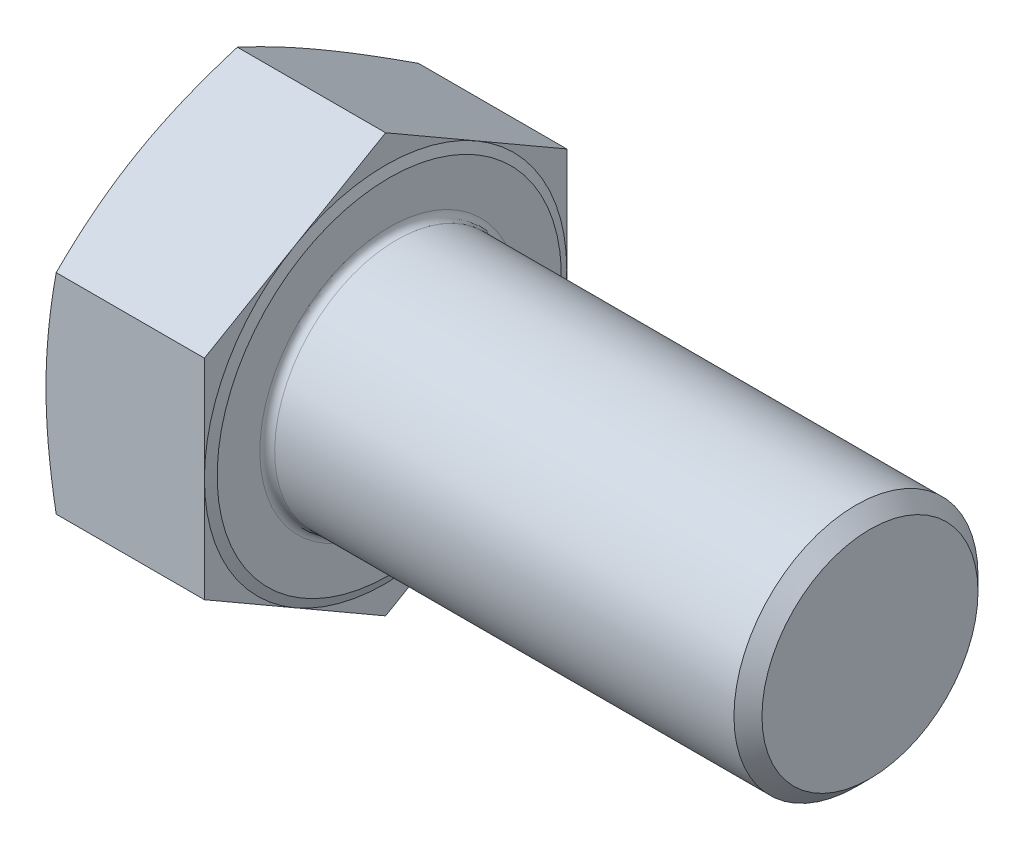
ISO-10303-21;
HEADER;
FILE_DESCRIPTION(('STEP AP214'),'2;1');
FILE_NAME('part.step','',(''),(''),'','','');
FILE_SCHEMA(('AUTOMOTIVE_DESIGN { 1 0 10303 214 1 1 1 1 }'));
ENDSEC;
DATA;
#1=APPLICATION_CONTEXT('core data for automotive mechanical design processes');
#2=APPLICATION_PROTOCOL_DEFINITION('international standard','automotive_design',2000,#1);
#3=PRODUCT_CONTEXT('',#1,'mechanical');
#4=PRODUCT('Part','Part','',(#3));
#5=PRODUCT_RELATED_PRODUCT_CATEGORY('part','',(#4));
#6=PRODUCT_DEFINITION_FORMATION('','',#4);
#7=PRODUCT_DEFINITION_CONTEXT('part definition',#1,'design');
#8=PRODUCT_DEFINITION('design','',#6,#7);
#9=PRODUCT_DEFINITION_SHAPE('','',#8);
#10=(LENGTH_UNIT() NAMED_UNIT(*) SI_UNIT(.MILLI.,.METRE.));
#11=(NAMED_UNIT(*) PLANE_ANGLE_UNIT() SI_UNIT($,.RADIAN.));
#12=(NAMED_UNIT(*) SI_UNIT($,.STERADIAN.) SOLID_ANGLE_UNIT());
#13=UNCERTAINTY_MEASURE_WITH_UNIT(LENGTH_MEASURE(1.E-05),#10,'distance_accuracy_value','');
#14=(GEOMETRIC_REPRESENTATION_CONTEXT(3) GLOBAL_UNCERTAINTY_ASSIGNED_CONTEXT((#13)) GLOBAL_UNIT_ASSIGNED_CONTEXT((#10,
#11,#12)) REPRESENTATION_CONTEXT('',''));
#15=CARTESIAN_POINT('',(0.,0.,0.));
#16=DIRECTION('',(0.,0.,1.));
#17=DIRECTION('',(1.,0.,0.));
#18=AXIS2_PLACEMENT_3D('',#15,#16,#17);
#19=CARTESIAN_POINT('',(21.92,0.,0.));
#20=DIRECTION('',(-1.,0.,0.));
#21=DIRECTION('',(0.,-1.,0.));
#22=AXIS2_PLACEMENT_3D('',#19,#20,#21);
#23=PLANE('',#22);
#24=CARTESIAN_POINT('',(21.92,0.,0.));
#25=DIRECTION('',(-1.,0.,0.));
#26=DIRECTION('',(0.,-1.,0.));
#27=AXIS2_PLACEMENT_3D('',#24,#25,#26);
#28=CIRCLE('',#27,17.5);
#29=CARTESIAN_POINT('',(21.92,-17.5,0.));
#30=VERTEX_POINT('',#29);
#31=EDGE_CURVE('E11',#30,#30,#28,.T.);
#32=ORIENTED_EDGE('',*,*,#31,.T.);
#33=EDGE_LOOP('',(#32));
#34=FACE_BOUND('',#33,.T.);
#35=CARTESIAN_POINT('',(21.92,0.,0.));
#36=DIRECTION('',(-1.,0.,0.));
#37=DIRECTION('',(0.,-1.,0.));
#38=AXIS2_PLACEMENT_3D('',#35,#36,#37);
#39=CIRCLE('',#38,23.275);
#40=CARTESIAN_POINT('',(21.92,-23.275,0.));
#41=VERTEX_POINT('',#40);
#42=EDGE_CURVE('E139',#41,#41,#39,.T.);
#43=ORIENTED_EDGE('',*,*,#42,.F.);
#44=EDGE_LOOP('',(#43));
#45=FACE_BOUND('',#44,.T.);
#46=ADVANCED_FACE('F32',(#34,#45),#23,.F.);
#47=CARTESIAN_POINT('',(21.42,-42.4352447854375,-24.5));
#48=DIRECTION('',(1.,0.,0.));
#49=DIRECTION('',(0.,0.,-1.));
#50=AXIS2_PLACEMENT_3D('',#47,#48,#49);
#51=PLANE('',#50);
#52=DIRECTION('',(0.,-0.5,-0.866025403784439));
#53=VECTOR('',#52,1.);
#54=CARTESIAN_POINT('',(21.42,-14.1450815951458,24.5));
#55=LINE('',#54,#53);
#56=CARTESIAN_POINT('',(21.42,-14.1450815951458,24.5));
#57=VERTEX_POINT('',#56);
#58=CARTESIAN_POINT('',(21.42,-21.2176223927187,12.25));
#59=VERTEX_POINT('',#58);
#60=EDGE_CURVE('E138',#57,#59,#55,.T.);
#61=ORIENTED_EDGE('',*,*,#60,.T.);
#62=CARTESIAN_POINT('',(21.42,0.,0.));
#63=DIRECTION('',(-1.,0.,0.));
#64=DIRECTION('',(0.,-1.,0.));
#65=AXIS2_PLACEMENT_3D('',#62,#63,#64);
#66=CIRCLE('',#65,24.5);
#67=CARTESIAN_POINT('',(21.42,0.,24.5));
#68=VERTEX_POINT('',#67);
#69=EDGE_CURVE('E48',#59,#68,#66,.T.);
#70=ORIENTED_EDGE('',*,*,#69,.T.);
#71=DIRECTION('',(0.,-1.,0.));
#72=VECTOR('',#71,1.);
#73=CARTESIAN_POINT('',(21.42,14.1450815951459,24.5));
#74=LINE('',#73,#72);
#75=EDGE_CURVE('E135',#68,#57,#74,.T.);
#76=ORIENTED_EDGE('',*,*,#75,.T.);
#77=EDGE_LOOP('',(#61,#70,#76));
#78=FACE_BOUND('',#77,.T.);
#79=ADVANCED_FACE('F134',(#78),#51,.T.);
#80=CARTESIAN_POINT('',(21.42,14.1450815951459,24.5));
#81=VERTEX_POINT('',#80);
#82=EDGE_CURVE('E146',#81,#68,#74,.T.);
#83=ORIENTED_EDGE('',*,*,#82,.T.);
#84=CARTESIAN_POINT('',(21.42,21.2176223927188,12.25));
#85=VERTEX_POINT('',#84);
#86=EDGE_CURVE('E121',#68,#85,#66,.T.);
#87=ORIENTED_EDGE('',*,*,#86,.T.);
#88=DIRECTION('',(0.,-0.5,0.866025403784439));
#89=VECTOR('',#88,1.);
#90=CARTESIAN_POINT('',(21.42,28.2901631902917,0.));
#91=LINE('',#90,#89);
#92=EDGE_CURVE('E152',#85,#81,#91,.T.);
#93=ORIENTED_EDGE('',*,*,#92,.T.);
#94=EDGE_LOOP('',(#83,#87,#93));
#95=FACE_BOUND('',#94,.T.);
#96=ADVANCED_FACE('F151',(#95),#51,.T.);
#97=CARTESIAN_POINT('',(21.42,28.2901631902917,0.));
#98=VERTEX_POINT('',#97);
#99=EDGE_CURVE('E149',#98,#85,#91,.T.);
#100=ORIENTED_EDGE('',*,*,#99,.T.);
#101=CARTESIAN_POINT('',(21.42,21.2176223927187,-12.25));
#102=VERTEX_POINT('',#101);
#103=EDGE_CURVE('E125',#85,#102,#66,.T.);
#104=ORIENTED_EDGE('',*,*,#103,.T.);
#105=DIRECTION('',(0.,0.5,0.866025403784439));
#106=VECTOR('',#105,1.);
#107=CARTESIAN_POINT('',(21.42,14.1450815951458,-24.5));
#108=LINE('',#107,#106);
#109=EDGE_CURVE('E308',#102,#98,#108,.T.);
#110=ORIENTED_EDGE('',*,*,#109,.T.);
#111=EDGE_LOOP('',(#100,#104,#110));
#112=FACE_BOUND('',#111,.T.);
#113=ADVANCED_FACE('F320',(#112),#51,.T.);
#114=CARTESIAN_POINT('',(21.42,14.1450815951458,-24.5));
#115=VERTEX_POINT('',#114);
#116=EDGE_CURVE('E310',#115,#102,#108,.T.);
#117=ORIENTED_EDGE('',*,*,#116,.T.);
#118=CARTESIAN_POINT('',(21.42,0.,-24.5));
#119=VERTEX_POINT('',#118);
#120=EDGE_CURVE('E364',#102,#119,#66,.T.);
#121=ORIENTED_EDGE('',*,*,#120,.T.);
#122=DIRECTION('',(0.,1.,0.));
#123=VECTOR('',#122,1.);
#124=CARTESIAN_POINT('',(21.42,-14.1450815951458,-24.5));
#125=LINE('',#124,#123);
#126=EDGE_CURVE('E305',#119,#115,#125,.T.);
#127=ORIENTED_EDGE('',*,*,#126,.T.);
#128=EDGE_LOOP('',(#117,#121,#127));
#129=FACE_BOUND('',#128,.T.);
#130=ADVANCED_FACE('F365',(#129),#51,.T.);
#131=CARTESIAN_POINT('',(21.42,-14.1450815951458,-24.5));
#132=VERTEX_POINT('',#131);
#133=EDGE_CURVE('E303',#132,#119,#125,.T.);
#134=ORIENTED_EDGE('',*,*,#133,.T.);
#135=CARTESIAN_POINT('',(21.42,-21.2176223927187,-12.25));
#136=VERTEX_POINT('',#135);
#137=EDGE_CURVE('E348',#119,#136,#66,.T.);
#138=ORIENTED_EDGE('',*,*,#137,.T.);
#139=DIRECTION('',(0.,0.5,-0.866025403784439));
#140=VECTOR('',#139,1.);
#141=CARTESIAN_POINT('',(21.42,-28.2901631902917,0.));
#142=LINE('',#141,#140);
#143=EDGE_CURVE('E362',#136,#132,#142,.T.);
#144=ORIENTED_EDGE('',*,*,#143,.T.);
#145=EDGE_LOOP('',(#134,#138,#144));
#146=FACE_BOUND('',#145,.T.);
#147=ADVANCED_FACE('F363',(#146),#51,.T.);
#148=CARTESIAN_POINT('',(21.42,-28.2901631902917,0.));
#149=VERTEX_POINT('',#148);
#150=EDGE_CURVE('E311',#149,#136,#142,.T.);
#151=ORIENTED_EDGE('',*,*,#150,.T.);
#152=EDGE_CURVE('E140',#136,#59,#66,.T.);
#153=ORIENTED_EDGE('',*,*,#152,.T.);
#154=EDGE_CURVE('E357',#59,#149,#55,.T.);
#155=ORIENTED_EDGE('',*,*,#154,.T.);
#156=EDGE_LOOP('',(#151,#153,#155));
#157=FACE_BOUND('',#156,.T.);
#158=ADVANCED_FACE('F206',(#157),#51,.T.);
#159=CARTESIAN_POINT('',(21.42,-14.1450815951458,24.5));
#160=DIRECTION('',(0.,0.866025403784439,-0.5));
#161=DIRECTION('',(0.,0.5,0.866025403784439));
#162=AXIS2_PLACEMENT_3D('',#159,#160,#161);
#163=PLANE('',#162);
#164=CARTESIAN_POINT('',(1.37954861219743,-28.2902786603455,-0.000200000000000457));
#165=CARTESIAN_POINT('',(1.27293694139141,-27.9973434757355,0.50717862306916));
#166=CARTESIAN_POINT('',(1.17111989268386,-27.7039777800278,1.01530291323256));
#167=CARTESIAN_POINT('',(0.978129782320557,-27.1163453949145,2.0331120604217));
#168=CARTESIAN_POINT('',(0.886957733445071,-26.8220786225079,2.54279706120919));
#169=CARTESIAN_POINT('',(0.630902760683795,-25.9375429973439,4.07485770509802));
#170=CARTESIAN_POINT('',(0.483631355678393,-25.3459437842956,5.09953759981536));
#171=CARTESIAN_POINT('',(0.304650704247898,-24.4592941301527,6.63525984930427));
#172=CARTESIAN_POINT('',(0.252130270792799,-24.1652666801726,7.14453033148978));
#173=CARTESIAN_POINT('',(0.161428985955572,-23.5766492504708,8.16404562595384));
#174=CARTESIAN_POINT('',(0.12324821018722,-23.2820592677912,8.67429044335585));
#175=CARTESIAN_POINT('',(0.0618973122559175,-22.6925960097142,9.69527075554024));
#176=CARTESIAN_POINT('',(0.038721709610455,-22.3977228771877,10.206006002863));
#177=CARTESIAN_POINT('',(0.00777307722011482,-21.8077739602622,11.2278275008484));
#178=CARTESIAN_POINT('',(0.,-21.5126981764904,11.7389137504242));
#179=CARTESIAN_POINT('',(0.,-20.922546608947,12.7610862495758));
#180=CARTESIAN_POINT('',(0.00777307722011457,-20.6274708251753,13.2721724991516));
#181=CARTESIAN_POINT('',(0.0387217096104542,-20.0375219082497,14.293993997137));
#182=CARTESIAN_POINT('',(0.0618973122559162,-19.7426487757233,14.8047292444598));
#183=CARTESIAN_POINT('',(0.123248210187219,-19.1531855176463,15.8257095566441));
#184=CARTESIAN_POINT('',(0.161428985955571,-18.8585955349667,16.3359543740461));
#185=CARTESIAN_POINT('',(0.252130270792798,-18.2699781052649,17.3554696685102));
#186=CARTESIAN_POINT('',(0.304650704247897,-17.9759506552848,17.8647401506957));
#187=CARTESIAN_POINT('',(0.483631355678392,-17.0893010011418,19.4004624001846));
#188=CARTESIAN_POINT('',(0.630902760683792,-16.4977017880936,20.425142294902));
#189=CARTESIAN_POINT('',(0.886957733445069,-15.6131661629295,21.9572029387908));
#190=CARTESIAN_POINT('',(0.978129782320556,-15.318899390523,22.4668879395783));
#191=CARTESIAN_POINT('',(1.17111989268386,-14.7312670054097,23.4846970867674));
#192=CARTESIAN_POINT('',(1.27293694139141,-14.437901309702,23.9928213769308));
#193=CARTESIAN_POINT('',(1.37954861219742,-14.144966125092,24.5002));
#194=B_SPLINE_CURVE_WITH_KNOTS('',3,(#164,#165,#166,#167,#168,#169,#170,#171,#172,#173,#174,
#175,#176,#177,#178,#179,#180,#181,#182,#183,#184,#185,#186,#187,#188,#189,#190,#191,#192,#193),
.UNSPECIFIED.,.F.,.F.,(4,2,2,2,2,2,2,2,2,2,2,2,2,2,4),(0.,1.78642146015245,3.57301274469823,
7.14866503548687,8.91971216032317,10.6907686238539,12.4611778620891,14.2315816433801,
16.0019854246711,17.7723946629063,19.543451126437,21.3144982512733,24.890150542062,
26.6767418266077,28.4631632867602),.UNSPECIFIED.);
#195=CARTESIAN_POINT('',(1.37950658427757,-28.2901631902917,0.));
#196=VERTEX_POINT('',#195);
#197=CARTESIAN_POINT('',(0.,-21.2176223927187,12.25));
#198=VERTEX_POINT('',#197);
#199=EDGE_CURVE('E351',#196,#198,#194,.T.);
#200=ORIENTED_EDGE('',*,*,#199,.F.);
#201=DIRECTION('',(-1.,0.,0.));
#202=VECTOR('',#201,1.);
#203=CARTESIAN_POINT('',(21.42,-28.2901631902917,0.));
#204=LINE('',#203,#202);
#205=EDGE_CURVE('E169',#149,#196,#204,.T.);
#206=ORIENTED_EDGE('',*,*,#205,.F.);
#207=ORIENTED_EDGE('',*,*,#154,.F.);
#208=ORIENTED_EDGE('',*,*,#60,.F.);
#209=DIRECTION('',(-1.,0.,0.));
#210=VECTOR('',#209,1.);
#211=CARTESIAN_POINT('',(21.42,-14.1450815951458,24.5));
#212=LINE('',#211,#210);
#213=CARTESIAN_POINT('',(1.37950658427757,-14.1450815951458,24.5));
#214=VERTEX_POINT('',#213);
#215=EDGE_CURVE('E148',#57,#214,#212,.T.);
#216=ORIENTED_EDGE('',*,*,#215,.T.);
#217=EDGE_CURVE('E240',#198,#214,#194,.T.);
#218=ORIENTED_EDGE('',*,*,#217,.F.);
#219=EDGE_LOOP('',(#200,#206,#207,#208,#216,#218));
#220=FACE_BOUND('',#219,.T.);
#221=ADVANCED_FACE('F34',(#220),#163,.F.);
#222=CARTESIAN_POINT('',(21.42,-28.2901631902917,0.));
#223=DIRECTION('',(0.,0.866025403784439,0.5));
#224=DIRECTION('',(0.,-0.5,0.866025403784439));
#225=AXIS2_PLACEMENT_3D('',#222,#223,#224);
#226=PLANE('',#225);
#227=CARTESIAN_POINT('',(1.37954861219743,-14.144966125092,-24.5002));
#228=CARTESIAN_POINT('',(1.27293694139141,-14.437901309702,-23.9928213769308));
#229=CARTESIAN_POINT('',(1.17111989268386,-14.7312670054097,-23.4846970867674));
#230=CARTESIAN_POINT('',(0.978129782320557,-15.318899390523,-22.4668879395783));
#231=CARTESIAN_POINT('',(0.88695773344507,-15.6131661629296,-21.9572029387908));
#232=CARTESIAN_POINT('',(0.630902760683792,-16.4977017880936,-20.425142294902));
#233=CARTESIAN_POINT('',(0.483631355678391,-17.0893010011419,-19.4004624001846));
#234=CARTESIAN_POINT('',(0.304650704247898,-17.9759506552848,-17.8647401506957));
#235=CARTESIAN_POINT('',(0.2521302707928,-18.2699781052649,-17.3554696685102));
#236=CARTESIAN_POINT('',(0.161428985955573,-18.8585955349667,-16.3359543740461));
#237=CARTESIAN_POINT('',(0.12324821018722,-19.1531855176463,-15.8257095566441));
#238=CARTESIAN_POINT('',(0.061897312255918,-19.7426487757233,-14.8047292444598));
#239=CARTESIAN_POINT('',(0.0387217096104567,-20.0375219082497,-14.293993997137));
#240=CARTESIAN_POINT('',(0.00777307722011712,-20.6274708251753,-13.2721724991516));
#241=CARTESIAN_POINT('',(0.,-20.922546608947,-12.7610862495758));
#242=CARTESIAN_POINT('',(0.,-21.5126981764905,-11.7389137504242));
#243=CARTESIAN_POINT('',(0.00777307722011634,-21.8077739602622,-11.2278275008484));
#244=CARTESIAN_POINT('',(0.038721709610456,-22.3977228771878,-10.206006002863));
#245=CARTESIAN_POINT('',(0.0618973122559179,-22.6925960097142,-9.69527075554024));
#246=CARTESIAN_POINT('',(0.12324821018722,-23.2820592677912,-8.67429044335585));
#247=CARTESIAN_POINT('',(0.161428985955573,-23.5766492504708,-8.16404562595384));
#248=CARTESIAN_POINT('',(0.252130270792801,-24.1652666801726,-7.14453033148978));
#249=CARTESIAN_POINT('',(0.304650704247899,-24.4592941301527,-6.63525984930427));
#250=CARTESIAN_POINT('',(0.483631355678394,-25.3459437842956,-5.09953759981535));
#251=CARTESIAN_POINT('',(0.630902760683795,-25.9375429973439,-4.07485770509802));
#252=CARTESIAN_POINT('',(0.886957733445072,-26.8220786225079,-2.54279706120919));
#253=CARTESIAN_POINT('',(0.978129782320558,-27.1163453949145,-2.0331120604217));
#254=CARTESIAN_POINT('',(1.17111989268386,-27.7039777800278,-1.01530291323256));
#255=CARTESIAN_POINT('',(1.27293694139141,-27.9973434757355,-0.507178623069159));
#256=CARTESIAN_POINT('',(1.37954861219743,-28.2902786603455,0.000200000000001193));
#257=B_SPLINE_CURVE_WITH_KNOTS('',3,(#227,#228,#229,#230,#231,#232,#233,#234,#235,#236,#237,
#238,#239,#240,#241,#242,#243,#244,#245,#246,#247,#248,#249,#250,#251,#252,#253,#254,#255,#256),
.UNSPECIFIED.,.F.,.F.,(4,2,2,2,2,2,2,2,2,2,2,2,2,2,4),(0.,1.78642146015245,3.57301274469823,
7.14866503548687,8.91971216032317,10.6907686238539,12.4611778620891,14.2315816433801,
16.0019854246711,17.7723946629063,19.543451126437,21.3144982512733,24.890150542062,
26.6767418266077,28.4631632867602),.UNSPECIFIED.);
#258=CARTESIAN_POINT('',(1.37950658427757,-14.1450815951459,-24.5));
#259=VERTEX_POINT('',#258);
#260=CARTESIAN_POINT('',(0.,-21.2176223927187,-12.25));
#261=VERTEX_POINT('',#260);
#262=EDGE_CURVE('E254',#259,#261,#257,.T.);
#263=ORIENTED_EDGE('',*,*,#262,.F.);
#264=DIRECTION('',(-1.,0.,0.));
#265=VECTOR('',#264,1.);
#266=CARTESIAN_POINT('',(21.42,-14.1450815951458,-24.5));
#267=LINE('',#266,#265);
#268=EDGE_CURVE('E166',#132,#259,#267,.T.);
#269=ORIENTED_EDGE('',*,*,#268,.F.);
#270=ORIENTED_EDGE('',*,*,#143,.F.);
#271=ORIENTED_EDGE('',*,*,#150,.F.);
#272=ORIENTED_EDGE('',*,*,#205,.T.);
#273=EDGE_CURVE('E250',#261,#196,#257,.T.);
#274=ORIENTED_EDGE('',*,*,#273,.F.);
#275=EDGE_LOOP('',(#263,#269,#270,#271,#272,#274));
#276=FACE_BOUND('',#275,.T.);
#277=ADVANCED_FACE('F261',(#276),#226,.F.);
#278=CARTESIAN_POINT('',(21.42,-14.1450815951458,-24.5));
#279=DIRECTION('',(0.,0.,1.));
#280=DIRECTION('',(0.,-1.,0.));
#281=AXIS2_PLACEMENT_3D('',#278,#279,#280);
#282=PLANE('',#281);
#283=CARTESIAN_POINT('',(7.37153610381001,-37.4512023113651,-24.5));
#284=CARTESIAN_POINT('',(7.20273071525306,-36.8969761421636,-24.5));
#285=CARTESIAN_POINT('',(7.03494618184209,-36.342439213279,-24.5));
#286=CARTESIAN_POINT('',(6.70164736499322,-35.2326801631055,-24.5));
#287=CARTESIAN_POINT('',(6.5361330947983,-34.6774580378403,-24.5));
#288=CARTESIAN_POINT('',(6.04331714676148,-33.0105959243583,-24.5));
#289=CARTESIAN_POINT('',(5.71976735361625,-31.8978421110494,-24.5));
#290=CARTESIAN_POINT('',(5.08438525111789,-29.6667408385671,-24.5));
#291=CARTESIAN_POINT('',(4.77257592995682,-28.5483868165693,-24.5));
#292=CARTESIAN_POINT('',(4.16429849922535,-26.3075191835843,-24.5));
#293=CARTESIAN_POINT('',(3.86783011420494,-25.1850056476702,-24.5));
#294=CARTESIAN_POINT('',(3.29757977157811,-22.9489412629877,-24.5));
#295=CARTESIAN_POINT('',(3.0235631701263,-21.8354505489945,-24.5));
#296=CARTESIAN_POINT('',(2.49885882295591,-19.602928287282,-24.5));
#297=CARTESIAN_POINT('',(2.24817146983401,-18.4838966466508,-24.5));
#298=CARTESIAN_POINT('',(1.77597066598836,-16.2400420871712,-24.5));
#299=CARTESIAN_POINT('',(1.55444726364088,-15.1152212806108,-24.5));
#300=CARTESIAN_POINT('',(1.14731954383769,-12.8590493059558,-24.5));
#301=CARTESIAN_POINT('',(0.961714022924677,-11.727698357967,-24.5));
#302=CARTESIAN_POINT('',(0.652339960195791,-9.58586065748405,-24.5));
#303=CARTESIAN_POINT('',(0.523971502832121,-8.57604457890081,-24.5));
#304=CARTESIAN_POINT('',(0.306674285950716,-6.55214241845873,-24.5));
#305=CARTESIAN_POINT('',(0.217744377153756,-5.53805646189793,-24.5));
#306=CARTESIAN_POINT('',(0.0836069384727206,-3.50767148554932,-24.5));
#307=CARTESIAN_POINT('',(0.038368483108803,-2.49137454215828,-24.5));
#308=CARTESIAN_POINT('',(-0.00609563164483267,-0.457763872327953,-24.5));
#309=CARTESIAN_POINT('',(-0.00532161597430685,0.559549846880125,-24.5));
#310=CARTESIAN_POINT('',(0.042317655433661,2.59824171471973,-24.5));
#311=CARTESIAN_POINT('',(0.0894166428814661,3.61961431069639,-24.5));
#312=CARTESIAN_POINT('',(0.227538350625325,5.6593594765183,-24.5));
#313=CARTESIAN_POINT('',(0.318562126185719,6.67773197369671,-24.5));
#314=CARTESIAN_POINT('',(0.540275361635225,8.71097408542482,-24.5));
#315=CARTESIAN_POINT('',(0.670998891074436,9.725839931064,-24.5));
#316=CARTESIAN_POINT('',(0.966809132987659,11.7504944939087,-24.5));
#317=CARTESIAN_POINT('',(1.13189602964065,12.7602831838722,-24.5));
#318=CARTESIAN_POINT('',(1.50055978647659,14.8279200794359,-24.5));
#319=CARTESIAN_POINT('',(1.70571067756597,15.8854851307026,-24.5));
#320=CARTESIAN_POINT('',(2.14241659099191,17.9951843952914,-24.5));
#321=CARTESIAN_POINT('',(2.37397360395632,19.0473181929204,-24.5));
#322=CARTESIAN_POINT('',(2.8586295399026,21.1469046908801,-24.5));
#323=CARTESIAN_POINT('',(3.11173471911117,22.1943559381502,-24.5));
#324=CARTESIAN_POINT('',(3.63536971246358,24.2848459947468,-24.5));
#325=CARTESIAN_POINT('',(3.90589910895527,25.3278849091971,-24.5));
#326=CARTESIAN_POINT('',(4.46148207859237,27.4115083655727,-24.5));
#327=CARTESIAN_POINT('',(4.74655385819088,28.4520880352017,-24.5));
#328=CARTESIAN_POINT('',(5.32829383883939,30.5299963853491,-24.5));
#329=CARTESIAN_POINT('',(5.62496208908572,31.5673250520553,-24.5));
#330=CARTESIAN_POINT('',(6.22777248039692,33.6390312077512,-24.5));
#331=CARTESIAN_POINT('',(6.53391302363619,34.6734091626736,-24.5));
#332=CARTESIAN_POINT('',(7.15406959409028,36.7397951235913,-24.5));
#333=CARTESIAN_POINT('',(7.46808560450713,37.7718031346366,-24.5));
#334=CARTESIAN_POINT('',(8.09917818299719,39.8224136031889,-24.5));
#335=CARTESIAN_POINT('',(8.41618268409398,40.8410382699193,-24.5));
#336=CARTESIAN_POINT('',(9.05559160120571,42.8765897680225,-24.5));
#337=CARTESIAN_POINT('',(9.37799601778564,43.8935165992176,-24.5));
#338=CARTESIAN_POINT('',(10.0273937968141,45.9259541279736,-24.5));
#339=CARTESIAN_POINT('',(10.3543873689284,46.9414647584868,-24.5));
#340=CARTESIAN_POINT('',(11.0122763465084,48.9712215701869,-24.5));
#341=CARTESIAN_POINT('',(11.3431717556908,49.9854677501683,-24.5));
#342=CARTESIAN_POINT('',(12.0070492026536,52.00901284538,-24.5));
#343=CARTESIAN_POINT('',(12.3400185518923,53.0183159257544,-24.5));
#344=CARTESIAN_POINT('',(13.0088305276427,55.0359698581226,-24.5));
#345=CARTESIAN_POINT('',(13.3446731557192,56.0443207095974,-24.5));
#346=CARTESIAN_POINT('',(14.0188253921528,58.0601052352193,-24.5));
#347=CARTESIAN_POINT('',(14.3571347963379,59.067538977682,-24.5));
#348=CARTESIAN_POINT('',(15.0359426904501,61.0816660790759,-24.5));
#349=CARTESIAN_POINT('',(15.3764411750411,62.0883594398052,-24.5));
#350=CARTESIAN_POINT('',(15.7178824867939,63.0947321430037,-24.5));
#351=B_SPLINE_CURVE_WITH_KNOTS('',3,(#283,#284,#285,#286,#287,#288,#289,#290,#291,#292,#293,
#294,#295,#296,#297,#298,#299,#300,#301,#302,#303,#304,#305,#306,#307,#308,#309,#310,#311,#312,
#313,#314,#315,#316,#317,#318,#319,#320,#321,#322,#323,#324,#325,#326,#327,#328,#329,#330,#331,
#332,#333,#334,#335,#336,#337,#338,#339,#340,#341,#342,#343,#344,#345,#346,#347,#348,#349,#350),
.UNSPECIFIED.,.F.,.F.,(4,2,2,2,2,2,2,2,2,2,2,2,2,2,2,2,2,2,2,2,2,2,2,2,2,2,2,2,2,2,2,2,2,4),(0.,
1.7380882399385,3.47618661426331,6.95264030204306,10.4355801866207,13.9184575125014,
17.3583927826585,20.7983859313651,24.2372021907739,27.6759032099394,30.7290603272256,
33.7821284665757,36.8330340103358,39.8839180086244,42.9502745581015,46.0167047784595,
49.0857740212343,52.1548597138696,55.3862843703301,58.6179527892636,61.8505627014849,
65.0830951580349,68.3197789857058,71.5564765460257,74.7926310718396,78.0287786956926,
81.2291974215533,84.4296164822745,87.6301822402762,90.8307510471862,94.019170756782,
97.2075922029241,100.395752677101,103.583905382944),.UNSPECIFIED.);
#352=CARTESIAN_POINT('',(1.37950658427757,14.1450815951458,-24.5));
#353=VERTEX_POINT('',#352);
#354=CARTESIAN_POINT('',(0.,0.,-24.5));
#355=VERTEX_POINT('',#354);
#356=EDGE_CURVE('E295',#353,#355,#351,.F.);
#357=ORIENTED_EDGE('',*,*,#356,.F.);
#358=DIRECTION('',(-1.,0.,0.));
#359=VECTOR('',#358,1.);
#360=CARTESIAN_POINT('',(21.42,14.1450815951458,-24.5));
#361=LINE('',#360,#359);
#362=EDGE_CURVE('E163',#115,#353,#361,.T.);
#363=ORIENTED_EDGE('',*,*,#362,.F.);
#364=ORIENTED_EDGE('',*,*,#126,.F.);
#365=ORIENTED_EDGE('',*,*,#133,.F.);
#366=ORIENTED_EDGE('',*,*,#268,.T.);
#367=EDGE_CURVE('E255',#355,#259,#351,.F.);
#368=ORIENTED_EDGE('',*,*,#367,.F.);
#369=EDGE_LOOP('',(#357,#363,#364,#365,#366,#368));
#370=FACE_BOUND('',#369,.T.);
#371=ADVANCED_FACE('F264',(#370),#282,.F.);
#372=CARTESIAN_POINT('',(21.42,14.1450815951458,-24.5));
#373=DIRECTION('',(0.,-0.866025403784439,0.5));
#374=DIRECTION('',(0.,-0.5,-0.866025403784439));
#375=AXIS2_PLACEMENT_3D('',#372,#373,#374);
#376=PLANE('',#375);
#377=CARTESIAN_POINT('',(1.37954861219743,28.2902786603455,0.000199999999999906));
#378=CARTESIAN_POINT('',(1.27293694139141,27.9973434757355,-0.507178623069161));
#379=CARTESIAN_POINT('',(1.17111989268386,27.7039777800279,-1.01530291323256));
#380=CARTESIAN_POINT('',(0.978129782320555,27.1163453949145,-2.0331120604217));
#381=CARTESIAN_POINT('',(0.886957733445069,26.822078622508,-2.54279706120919));
#382=CARTESIAN_POINT('',(0.630902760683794,25.9375429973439,-4.07485770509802));
#383=CARTESIAN_POINT('',(0.483631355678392,25.3459437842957,-5.09953759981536));
#384=CARTESIAN_POINT('',(0.304650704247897,24.4592941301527,-6.63525984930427));
#385=CARTESIAN_POINT('',(0.252130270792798,24.1652666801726,-7.14453033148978));
#386=CARTESIAN_POINT('',(0.161428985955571,23.5766492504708,-8.16404562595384));
#387=CARTESIAN_POINT('',(0.123248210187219,23.2820592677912,-8.67429044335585));
#388=CARTESIAN_POINT('',(0.0618973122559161,22.6925960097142,-9.69527075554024));
#389=CARTESIAN_POINT('',(0.0387217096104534,22.3977228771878,-10.206006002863));
#390=CARTESIAN_POINT('',(0.00777307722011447,21.8077739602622,-11.2278275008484));
#391=CARTESIAN_POINT('',(0.,21.5126981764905,-11.7389137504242));
#392=CARTESIAN_POINT('',(0.,20.9225466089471,-12.7610862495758));
#393=CARTESIAN_POINT('',(0.00777307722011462,20.6274708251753,-13.2721724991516));
#394=CARTESIAN_POINT('',(0.0387217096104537,20.0375219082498,-14.293993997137));
#395=CARTESIAN_POINT('',(0.0618973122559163,19.7426487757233,-14.8047292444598));
#396=CARTESIAN_POINT('',(0.123248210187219,19.1531855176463,-15.8257095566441));
#397=CARTESIAN_POINT('',(0.161428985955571,18.8585955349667,-16.3359543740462));
#398=CARTESIAN_POINT('',(0.252130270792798,18.2699781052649,-17.3554696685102));
#399=CARTESIAN_POINT('',(0.304650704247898,17.9759506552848,-17.8647401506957));
#400=CARTESIAN_POINT('',(0.483631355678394,17.0893010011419,-19.4004624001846));
#401=CARTESIAN_POINT('',(0.630902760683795,16.4977017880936,-20.425142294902));
#402=CARTESIAN_POINT('',(0.886957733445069,15.6131661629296,-21.9572029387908));
#403=CARTESIAN_POINT('',(0.978129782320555,15.318899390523,-22.4668879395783));
#404=CARTESIAN_POINT('',(1.17111989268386,14.7312670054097,-23.4846970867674));
#405=CARTESIAN_POINT('',(1.27293694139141,14.4379013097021,-23.9928213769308));
#406=CARTESIAN_POINT('',(1.37954861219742,14.144966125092,-24.5002));
#407=B_SPLINE_CURVE_WITH_KNOTS('',3,(#377,#378,#379,#380,#381,#382,#383,#384,#385,#386,#387,
#388,#389,#390,#391,#392,#393,#394,#395,#396,#397,#398,#399,#400,#401,#402,#403,#404,#405,#406),
.UNSPECIFIED.,.F.,.F.,(4,2,2,2,2,2,2,2,2,2,2,2,2,2,4),(0.,1.78642146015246,3.57301274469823,
7.14866503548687,8.91971216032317,10.6907686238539,12.4611778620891,14.2315816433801,
16.0019854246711,17.7723946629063,19.543451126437,21.3144982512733,24.890150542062,
26.6767418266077,28.4631632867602),.UNSPECIFIED.);
#408=CARTESIAN_POINT('',(1.37950658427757,28.2901631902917,0.));
#409=VERTEX_POINT('',#408);
#410=CARTESIAN_POINT('',(0.,21.2176223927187,-12.25));
#411=VERTEX_POINT('',#410);
#412=EDGE_CURVE('E56',#409,#411,#407,.T.);
#413=ORIENTED_EDGE('',*,*,#412,.F.);
#414=DIRECTION('',(-1.,0.,0.));
#415=VECTOR('',#414,1.);
#416=CARTESIAN_POINT('',(21.42,28.2901631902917,0.));
#417=LINE('',#416,#415);
#418=EDGE_CURVE('E160',#98,#409,#417,.T.);
#419=ORIENTED_EDGE('',*,*,#418,.F.);
#420=ORIENTED_EDGE('',*,*,#109,.F.);
#421=ORIENTED_EDGE('',*,*,#116,.F.);
#422=ORIENTED_EDGE('',*,*,#362,.T.);
#423=EDGE_CURVE('E296',#411,#353,#407,.T.);
#424=ORIENTED_EDGE('',*,*,#423,.F.);
#425=EDGE_LOOP('',(#413,#419,#420,#421,#422,#424));
#426=FACE_BOUND('',#425,.T.);
#427=ADVANCED_FACE('F268',(#426),#376,.F.);
#428=CARTESIAN_POINT('',(21.42,28.2901631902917,0.));
#429=DIRECTION('',(0.,-0.866025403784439,-0.5));
#430=DIRECTION('',(0.,0.5,-0.866025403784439));
#431=AXIS2_PLACEMENT_3D('',#428,#429,#430);
#432=PLANE('',#431);
#433=CARTESIAN_POINT('',(1.37954861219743,14.144966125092,24.5002));
#434=CARTESIAN_POINT('',(1.27293694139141,14.4379013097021,23.9928213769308));
#435=CARTESIAN_POINT('',(1.17111989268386,14.7312670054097,23.4846970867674));
#436=CARTESIAN_POINT('',(0.978129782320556,15.318899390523,22.4668879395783));
#437=CARTESIAN_POINT('',(0.88695773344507,15.6131661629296,21.9572029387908));
#438=CARTESIAN_POINT('',(0.630902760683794,16.4977017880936,20.425142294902));
#439=CARTESIAN_POINT('',(0.483631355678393,17.0893010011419,19.4004624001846));
#440=CARTESIAN_POINT('',(0.304650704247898,17.9759506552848,17.8647401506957));
#441=CARTESIAN_POINT('',(0.2521302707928,18.2699781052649,17.3554696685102));
#442=CARTESIAN_POINT('',(0.161428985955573,18.8585955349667,16.3359543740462));
#443=CARTESIAN_POINT('',(0.123248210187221,19.1531855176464,15.8257095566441));
#444=CARTESIAN_POINT('',(0.0618973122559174,19.7426487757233,14.8047292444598));
#445=CARTESIAN_POINT('',(0.0387217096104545,20.0375219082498,14.293993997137));
#446=CARTESIAN_POINT('',(0.00777307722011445,20.6274708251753,13.2721724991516));
#447=CARTESIAN_POINT('',(0.,20.9225466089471,12.7610862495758));
#448=CARTESIAN_POINT('',(0.,21.5126981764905,11.7389137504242));
#449=CARTESIAN_POINT('',(0.00777307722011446,21.8077739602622,11.2278275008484));
#450=CARTESIAN_POINT('',(0.038721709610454,22.3977228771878,10.206006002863));
#451=CARTESIAN_POINT('',(0.0618973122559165,22.6925960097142,9.69527075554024));
#452=CARTESIAN_POINT('',(0.123248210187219,23.2820592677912,8.67429044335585));
#453=CARTESIAN_POINT('',(0.161428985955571,23.5766492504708,8.16404562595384));
#454=CARTESIAN_POINT('',(0.252130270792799,24.1652666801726,7.14453033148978));
#455=CARTESIAN_POINT('',(0.304650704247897,24.4592941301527,6.63525984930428));
#456=CARTESIAN_POINT('',(0.483631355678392,25.3459437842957,5.09953759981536));
#457=CARTESIAN_POINT('',(0.630902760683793,25.9375429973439,4.07485770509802));
#458=CARTESIAN_POINT('',(0.88695773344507,26.822078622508,2.54279706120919));
#459=CARTESIAN_POINT('',(0.978129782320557,27.1163453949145,2.0331120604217));
#460=CARTESIAN_POINT('',(1.17111989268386,27.7039777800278,1.01530291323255));
#461=CARTESIAN_POINT('',(1.27293694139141,27.9973434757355,0.507178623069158));
#462=CARTESIAN_POINT('',(1.37954861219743,28.2902786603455,-0.000200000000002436));
#463=B_SPLINE_CURVE_WITH_KNOTS('',3,(#433,#434,#435,#436,#437,#438,#439,#440,#441,#442,#443,
#444,#445,#446,#447,#448,#449,#450,#451,#452,#453,#454,#455,#456,#457,#458,#459,#460,#461,#462),
.UNSPECIFIED.,.F.,.F.,(4,2,2,2,2,2,2,2,2,2,2,2,2,2,4),(0.,1.78642146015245,3.57301274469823,
7.14866503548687,8.91971216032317,10.6907686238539,12.4611778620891,14.2315816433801,
16.0019854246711,17.7723946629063,19.543451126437,21.3144982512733,24.890150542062,
26.6767418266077,28.4631632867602),.UNSPECIFIED.);
#464=CARTESIAN_POINT('',(1.37950658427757,14.1450815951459,24.5));
#465=VERTEX_POINT('',#464);
#466=CARTESIAN_POINT('',(0.,21.2176223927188,12.25));
#467=VERTEX_POINT('',#466);
#468=EDGE_CURVE('E233',#465,#467,#463,.T.);
#469=ORIENTED_EDGE('',*,*,#468,.F.);
#470=DIRECTION('',(-1.,0.,0.));
#471=VECTOR('',#470,1.);
#472=CARTESIAN_POINT('',(21.42,14.1450815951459,24.5));
#473=LINE('',#472,#471);
#474=EDGE_CURVE('E154',#81,#465,#473,.T.);
#475=ORIENTED_EDGE('',*,*,#474,.F.);
#476=ORIENTED_EDGE('',*,*,#92,.F.);
#477=ORIENTED_EDGE('',*,*,#99,.F.);
#478=ORIENTED_EDGE('',*,*,#418,.T.);
#479=EDGE_CURVE('E356',#467,#409,#463,.T.);
#480=ORIENTED_EDGE('',*,*,#479,.F.);
#481=EDGE_LOOP('',(#469,#475,#476,#477,#478,#480));
#482=FACE_BOUND('',#481,.T.);
#483=ADVANCED_FACE('F272',(#482),#432,.F.);
#484=CARTESIAN_POINT('',(21.42,14.1450815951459,24.5));
#485=DIRECTION('',(0.,0.,-1.));
#486=DIRECTION('',(-1.,0.,0.));
#487=AXIS2_PLACEMENT_3D('',#484,#485,#486);
#488=PLANE('',#487);
#489=CARTESIAN_POINT('',(7.37153610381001,-37.4512023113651,24.5));
#490=CARTESIAN_POINT('',(7.20273071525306,-36.8969761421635,24.5));
#491=CARTESIAN_POINT('',(7.0349461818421,-36.3424392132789,24.5));
#492=CARTESIAN_POINT('',(6.70164736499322,-35.2326801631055,24.5));
#493=CARTESIAN_POINT('',(6.5361330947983,-34.6774580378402,24.5));
#494=CARTESIAN_POINT('',(6.04331714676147,-33.0105959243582,24.5));
#495=CARTESIAN_POINT('',(5.71976735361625,-31.8978421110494,24.5));
#496=CARTESIAN_POINT('',(5.08438525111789,-29.6667408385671,24.5));
#497=CARTESIAN_POINT('',(4.77257592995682,-28.5483868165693,24.5));
#498=CARTESIAN_POINT('',(4.16429849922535,-26.3075191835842,24.5));
#499=CARTESIAN_POINT('',(3.86783011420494,-25.1850056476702,24.5));
#500=CARTESIAN_POINT('',(3.29757977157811,-22.9489412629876,24.5));
#501=CARTESIAN_POINT('',(3.0235631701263,-21.8354505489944,24.5));
#502=CARTESIAN_POINT('',(2.49885882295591,-19.602928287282,24.5));
#503=CARTESIAN_POINT('',(2.24817146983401,-18.4838966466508,24.5));
#504=CARTESIAN_POINT('',(1.77597066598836,-16.2400420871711,24.5));
#505=CARTESIAN_POINT('',(1.55444726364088,-15.1152212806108,24.5));
#506=CARTESIAN_POINT('',(1.14731954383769,-12.8590493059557,24.5));
#507=CARTESIAN_POINT('',(0.961714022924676,-11.727698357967,24.5));
#508=CARTESIAN_POINT('',(0.652339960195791,-9.58586065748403,24.5));
#509=CARTESIAN_POINT('',(0.523971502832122,-8.5760445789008,24.5));
#510=CARTESIAN_POINT('',(0.306674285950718,-6.55214241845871,24.5));
#511=CARTESIAN_POINT('',(0.217744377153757,-5.53805646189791,24.5));
#512=CARTESIAN_POINT('',(0.0836069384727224,-3.50767148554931,24.5));
#513=CARTESIAN_POINT('',(0.0383684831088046,-2.49137454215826,24.5));
#514=CARTESIAN_POINT('',(-0.00609563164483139,-0.457763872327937,24.5));
#515=CARTESIAN_POINT('',(-0.00532161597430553,0.559549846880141,24.5));
#516=CARTESIAN_POINT('',(0.042317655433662,2.59824171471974,24.5));
#517=CARTESIAN_POINT('',(0.0894166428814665,3.61961431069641,24.5));
#518=CARTESIAN_POINT('',(0.227538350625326,5.65935947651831,24.5));
#519=CARTESIAN_POINT('',(0.318562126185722,6.67773197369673,24.5));
#520=CARTESIAN_POINT('',(0.540275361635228,8.71097408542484,24.5));
#521=CARTESIAN_POINT('',(0.670998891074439,9.72583993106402,24.5));
#522=CARTESIAN_POINT('',(0.966809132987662,11.7504944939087,24.5));
#523=CARTESIAN_POINT('',(1.13189602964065,12.7602831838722,24.5));
#524=CARTESIAN_POINT('',(1.50055978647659,14.8279200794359,24.5));
#525=CARTESIAN_POINT('',(1.70571067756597,15.8854851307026,24.5));
#526=CARTESIAN_POINT('',(2.14241659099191,17.9951843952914,24.5));
#527=CARTESIAN_POINT('',(2.37397360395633,19.0473181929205,24.5));
#528=CARTESIAN_POINT('',(2.85862953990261,21.1469046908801,24.5));
#529=CARTESIAN_POINT('',(3.11173471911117,22.1943559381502,24.5));
#530=CARTESIAN_POINT('',(3.63536971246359,24.2848459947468,24.5));
#531=CARTESIAN_POINT('',(3.90589910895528,25.3278849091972,24.5));
#532=CARTESIAN_POINT('',(4.46148207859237,27.4115083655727,24.5));
#533=CARTESIAN_POINT('',(4.74655385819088,28.4520880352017,24.5));
#534=CARTESIAN_POINT('',(5.32829383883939,30.5299963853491,24.5));
#535=CARTESIAN_POINT('',(5.62496208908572,31.5673250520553,24.5));
#536=CARTESIAN_POINT('',(6.22777248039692,33.6390312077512,24.5));
#537=CARTESIAN_POINT('',(6.53391302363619,34.6734091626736,24.5));
#538=CARTESIAN_POINT('',(7.15406959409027,36.7397951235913,24.5));
#539=CARTESIAN_POINT('',(7.46808560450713,37.7718031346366,24.5));
#540=CARTESIAN_POINT('',(8.09917818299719,39.8224136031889,24.5));
#541=CARTESIAN_POINT('',(8.41618268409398,40.8410382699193,24.5));
#542=CARTESIAN_POINT('',(9.0555916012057,42.8765897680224,24.5));
#543=CARTESIAN_POINT('',(9.37799601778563,43.8935165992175,24.5));
#544=CARTESIAN_POINT('',(10.0273937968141,45.9259541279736,24.5));
#545=CARTESIAN_POINT('',(10.3543873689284,46.9414647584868,24.5));
#546=CARTESIAN_POINT('',(11.0122763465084,48.9712215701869,24.5));
#547=CARTESIAN_POINT('',(11.3431717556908,49.9854677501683,24.5));
#548=CARTESIAN_POINT('',(12.0070492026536,52.00901284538,24.5));
#549=CARTESIAN_POINT('',(12.3400185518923,53.0183159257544,24.5));
#550=CARTESIAN_POINT('',(13.0088305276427,55.0359698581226,24.5));
#551=CARTESIAN_POINT('',(13.3446731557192,56.0443207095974,24.5));
#552=CARTESIAN_POINT('',(14.0188253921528,58.0601052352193,24.5));
#553=CARTESIAN_POINT('',(14.3571347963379,59.0675389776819,24.5));
#554=CARTESIAN_POINT('',(15.0359426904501,61.0816660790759,24.5));
#555=CARTESIAN_POINT('',(15.3764411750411,62.0883594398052,24.5));
#556=CARTESIAN_POINT('',(15.7178824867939,63.0947321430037,24.5));
#557=B_SPLINE_CURVE_WITH_KNOTS('',3,(#489,#490,#491,#492,#493,#494,#495,#496,#497,#498,#499,
#500,#501,#502,#503,#504,#505,#506,#507,#508,#509,#510,#511,#512,#513,#514,#515,#516,#517,#518,
#519,#520,#521,#522,#523,#524,#525,#526,#527,#528,#529,#530,#531,#532,#533,#534,#535,#536,#537,
#538,#539,#540,#541,#542,#543,#544,#545,#546,#547,#548,#549,#550,#551,#552,#553,#554,#555,#556),
.UNSPECIFIED.,.F.,.F.,(4,2,2,2,2,2,2,2,2,2,2,2,2,2,2,2,2,2,2,2,2,2,2,2,2,2,2,2,2,2,2,2,2,4),(0.,
1.7380882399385,3.47618661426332,6.95264030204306,10.4355801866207,13.9184575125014,
17.3583927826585,20.7983859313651,24.2372021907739,27.6759032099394,30.7290603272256,
33.7821284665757,36.8330340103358,39.8839180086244,42.9502745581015,46.0167047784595,
49.0857740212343,52.1548597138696,55.3862843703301,58.6179527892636,61.8505627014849,
65.0830951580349,68.3197789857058,71.5564765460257,74.7926310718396,78.0287786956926,
81.2291974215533,84.4296164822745,87.6301822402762,90.8307510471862,94.019170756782,
97.2075922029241,100.395752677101,103.583905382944),.UNSPECIFIED.);
#558=CARTESIAN_POINT('',(0.,0.,24.5));
#559=VERTEX_POINT('',#558);
#560=EDGE_CURVE('E327',#214,#559,#557,.T.);
#561=ORIENTED_EDGE('',*,*,#560,.F.);
#562=ORIENTED_EDGE('',*,*,#215,.F.);
#563=ORIENTED_EDGE('',*,*,#75,.F.);
#564=ORIENTED_EDGE('',*,*,#82,.F.);
#565=ORIENTED_EDGE('',*,*,#474,.T.);
#566=EDGE_CURVE('E223',#559,#465,#557,.T.);
#567=ORIENTED_EDGE('',*,*,#566,.F.);
#568=EDGE_LOOP('',(#561,#562,#563,#564,#565,#567));
#569=FACE_BOUND('',#568,.T.);
#570=ADVANCED_FACE('F144',(#569),#488,.F.);
#571=CARTESIAN_POINT('',(0.,0.,0.));
#572=DIRECTION('',(1.,0.,0.));
#573=DIRECTION('',(0.,1.,0.));
#574=AXIS2_PLACEMENT_3D('',#571,#572,#573);
#575=CONICAL_SURFACE('',#574,24.5,1.22173047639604);
#576=ORIENTED_EDGE('',*,*,#367,.T.);
#577=ORIENTED_EDGE('',*,*,#262,.T.);
#578=CARTESIAN_POINT('',(0.,0.,0.));
#579=DIRECTION('',(1.,0.,0.));
#580=DIRECTION('',(0.,0.,-1.));
#581=AXIS2_PLACEMENT_3D('',#578,#579,#580);
#582=CIRCLE('',#581,24.5);
#583=EDGE_CURVE('E172',#261,#355,#582,.T.);
#584=ORIENTED_EDGE('',*,*,#583,.T.);
#585=EDGE_LOOP('',(#576,#577,#584));
#586=FACE_BOUND('',#585,.T.);
#587=ADVANCED_FACE('F218',(#586),#575,.T.);
#588=ORIENTED_EDGE('',*,*,#273,.T.);
#589=ORIENTED_EDGE('',*,*,#199,.T.);
#590=EDGE_CURVE('E175',#198,#261,#582,.T.);
#591=ORIENTED_EDGE('',*,*,#590,.T.);
#592=EDGE_LOOP('',(#588,#589,#591));
#593=FACE_BOUND('',#592,.T.);
#594=ADVANCED_FACE('F282',(#593),#575,.T.);
#595=ORIENTED_EDGE('',*,*,#217,.T.);
#596=ORIENTED_EDGE('',*,*,#560,.T.);
#597=CARTESIAN_POINT('',(0.,0.,0.));
#598=DIRECTION('',(-1.,0.,0.));
#599=DIRECTION('',(0.,-1.,0.));
#600=AXIS2_PLACEMENT_3D('',#597,#598,#599);
#601=CIRCLE('',#600,24.5);
#602=EDGE_CURVE('E330',#198,#559,#601,.T.);
#603=ORIENTED_EDGE('',*,*,#602,.F.);
#604=EDGE_LOOP('',(#595,#596,#603));
#605=FACE_BOUND('',#604,.T.);
#606=ADVANCED_FACE('F287',(#605),#575,.T.);
#607=ORIENTED_EDGE('',*,*,#468,.T.);
#608=EDGE_CURVE('E349',#467,#559,#582,.T.);
#609=ORIENTED_EDGE('',*,*,#608,.T.);
#610=ORIENTED_EDGE('',*,*,#566,.T.);
#611=EDGE_LOOP('',(#607,#609,#610));
#612=FACE_BOUND('',#611,.T.);
#613=ADVANCED_FACE('F219',(#612),#575,.T.);
#614=ORIENTED_EDGE('',*,*,#412,.T.);
#615=EDGE_CURVE('E346',#411,#467,#582,.T.);
#616=ORIENTED_EDGE('',*,*,#615,.T.);
#617=ORIENTED_EDGE('',*,*,#479,.T.);
#618=EDGE_LOOP('',(#614,#616,#617));
#619=FACE_BOUND('',#618,.T.);
#620=ADVANCED_FACE('F216',(#619),#575,.T.);
#621=ORIENTED_EDGE('',*,*,#356,.T.);
#622=EDGE_CURVE('E176',#355,#411,#582,.T.);
#623=ORIENTED_EDGE('',*,*,#622,.T.);
#624=ORIENTED_EDGE('',*,*,#423,.T.);
#625=EDGE_LOOP('',(#621,#623,#624));
#626=FACE_BOUND('',#625,.T.);
#627=ADVANCED_FACE('F211',(#626),#575,.T.);
#628=CARTESIAN_POINT('',(0.,-42.4352447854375,-24.5));
#629=DIRECTION('',(1.,0.,0.));
#630=DIRECTION('',(0.,0.,-1.));
#631=AXIS2_PLACEMENT_3D('',#628,#629,#630);
#632=PLANE('',#631);
#633=ORIENTED_EDGE('',*,*,#622,.F.);
#634=ORIENTED_EDGE('',*,*,#583,.F.);
#635=ORIENTED_EDGE('',*,*,#590,.F.);
#636=ORIENTED_EDGE('',*,*,#602,.T.);
#637=ORIENTED_EDGE('',*,*,#608,.F.);
#638=ORIENTED_EDGE('',*,*,#615,.F.);
#639=EDGE_LOOP('',(#633,#634,#635,#636,#637,#638));
#640=FACE_BOUND('',#639,.T.);
#641=ADVANCED_FACE('F215',(#640),#632,.F.);
#642=CARTESIAN_POINT('',(21.92,0.,0.));
#643=DIRECTION('',(-1.,0.,0.));
#644=DIRECTION('',(0.,-1.,0.));
#645=AXIS2_PLACEMENT_3D('',#642,#643,#644);
#646=CONICAL_SURFACE('',#645,23.275,1.18327252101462);
#647=ORIENTED_EDGE('',*,*,#69,.F.);
#648=ORIENTED_EDGE('',*,*,#152,.F.);
#649=ORIENTED_EDGE('',*,*,#137,.F.);
#650=ORIENTED_EDGE('',*,*,#120,.F.);
#651=ORIENTED_EDGE('',*,*,#103,.F.);
#652=ORIENTED_EDGE('',*,*,#86,.F.);
#653=EDGE_LOOP('',(#647,#648,#649,#650,#651,#652));
#654=FACE_BOUND('',#653,.T.);
#655=ORIENTED_EDGE('',*,*,#42,.T.);
#656=EDGE_LOOP('',(#655));
#657=FACE_BOUND('',#656,.T.);
#658=ADVANCED_FACE('F122',(#654,#657),#646,.T.);
#659=CARTESIAN_POINT('',(86.92,0.,0.));
#660=DIRECTION('',(-1.,0.,0.));
#661=DIRECTION('',(0.,-1.,0.));
#662=AXIS2_PLACEMENT_3D('',#659,#660,#661);
#663=CYLINDRICAL_SURFACE('',#662,16.5);
#664=CARTESIAN_POINT('',(22.92,0.,0.));
#665=DIRECTION('',(-1.,0.,0.));
#666=DIRECTION('',(0.,-1.,0.));
#667=AXIS2_PLACEMENT_3D('',#664,#665,#666);
#668=CIRCLE('',#667,16.5);
#669=CARTESIAN_POINT('',(22.92,-16.5,0.));
#670=VERTEX_POINT('',#669);
#671=EDGE_CURVE('E41',#670,#670,#668,.F.);
#672=ORIENTED_EDGE('',*,*,#671,.T.);
#673=EDGE_LOOP('',(#672));
#674=FACE_BOUND('',#673,.T.);
#675=CARTESIAN_POINT('',(85.0255,0.,0.));
#676=DIRECTION('',(1.,0.,0.));
#677=DIRECTION('',(0.,1.,0.));
#678=AXIS2_PLACEMENT_3D('',#675,#676,#677);
#679=CIRCLE('',#678,16.5);
#680=CARTESIAN_POINT('',(85.0255,16.5,0.));
#681=VERTEX_POINT('',#680);
#682=EDGE_CURVE('E179',#681,#681,#679,.F.);
#683=ORIENTED_EDGE('',*,*,#682,.T.);
#684=EDGE_LOOP('',(#683));
#685=FACE_BOUND('',#684,.T.);
#686=ADVANCED_FACE('F184',(#674,#685),#663,.T.);
#687=CARTESIAN_POINT('',(86.92,0.,0.));
#688=DIRECTION('',(1.,0.,0.));
#689=DIRECTION('',(0.,1.,0.));
#690=AXIS2_PLACEMENT_3D('',#687,#688,#689);
#691=PLANE('',#690);
#692=CARTESIAN_POINT('',(86.92,0.,0.));
#693=DIRECTION('',(1.,0.,0.));
#694=DIRECTION('',(0.,1.,0.));
#695=AXIS2_PLACEMENT_3D('',#692,#693,#694);
#696=CIRCLE('',#695,14.6055);
#697=CARTESIAN_POINT('',(86.92,14.6055,0.));
#698=VERTEX_POINT('',#697);
#699=EDGE_CURVE('E129',#698,#698,#696,.T.);
#700=ORIENTED_EDGE('',*,*,#699,.T.);
#701=EDGE_LOOP('',(#700));
#702=FACE_BOUND('',#701,.T.);
#703=ADVANCED_FACE('F195',(#702),#691,.T.);
#704=CARTESIAN_POINT('',(86.92,0.,0.));
#705=DIRECTION('',(-1.,0.,0.));
#706=DIRECTION('',(0.,-1.,0.));
#707=AXIS2_PLACEMENT_3D('',#704,#705,#706);
#708=CONICAL_SURFACE('',#707,14.6055,0.785398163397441);
#709=ORIENTED_EDGE('',*,*,#682,.F.);
#710=EDGE_LOOP('',(#709));
#711=FACE_BOUND('',#710,.T.);
#712=ORIENTED_EDGE('',*,*,#699,.F.);
#713=EDGE_LOOP('',(#712));
#714=FACE_BOUND('',#713,.T.);
#715=ADVANCED_FACE('F189',(#711,#714),#708,.T.);
#716=CARTESIAN_POINT('',(22.92,0.,0.));
#717=DIRECTION('',(-1.,0.,0.));
#718=DIRECTION('',(0.,-1.,0.));
#719=AXIS2_PLACEMENT_3D('',#716,#717,#718);
#720=TOROIDAL_SURFACE('',#719,17.5,1.);
#721=ORIENTED_EDGE('',*,*,#31,.F.);
#722=EDGE_LOOP('',(#721));
#723=FACE_BOUND('',#722,.T.);
#724=ORIENTED_EDGE('',*,*,#671,.F.);
#725=EDGE_LOOP('',(#724));
#726=FACE_BOUND('',#725,.T.);
#727=ADVANCED_FACE('F187',(#723,#726),#720,.F.);
#728=CLOSED_SHELL('',(#46,#79,#96,#113,#130,#147,#158,#221,#277,#371,#427,#483,#570,#587,#594,
#606,#613,#620,#627,#641,#658,#686,#703,#715,#727));
#729=MANIFOLD_SOLID_BREP('B2',#728);
#730=ADVANCED_BREP_SHAPE_REPRESENTATION('',(#18,#729),#14);
#731=SHAPE_DEFINITION_REPRESENTATION(#9,#730);
ENDSEC;
END-ISO-10303-21;
